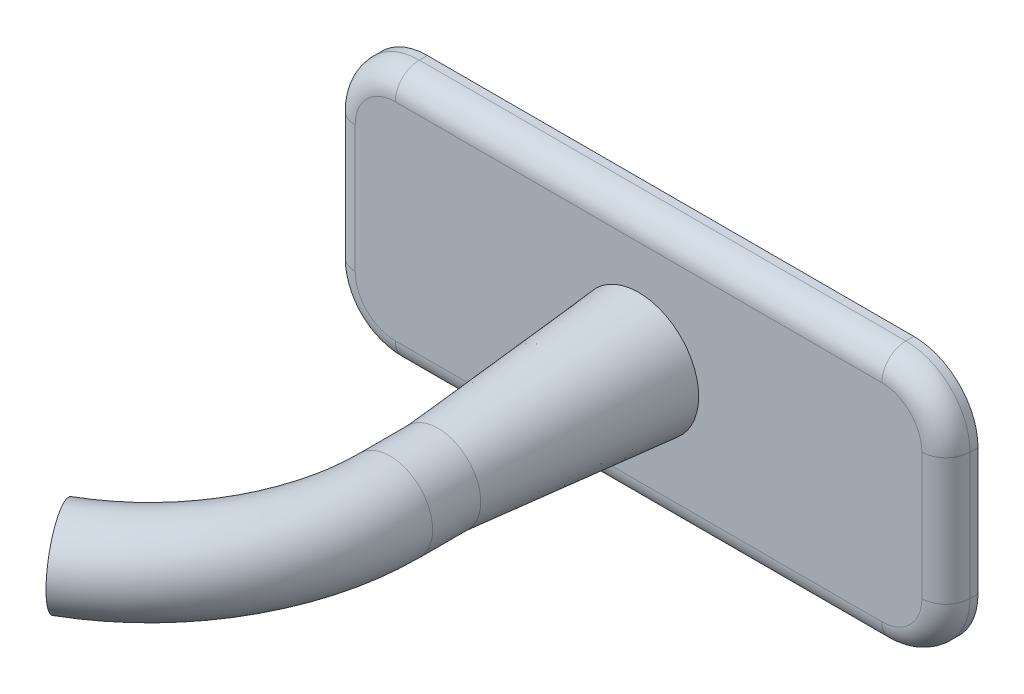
from build123d import *

# Parameters (mm, degrees)
SKETCH1_W           = 19.481999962
SKETCH1_H           = 8.08482
BOSS_EXTRUDE1_DEPTH = 1.016
FILLET1_R           = 2.032
FILLET2_R           = 0.762
SKETCH2_R           = 1.905
BOSS_EXTRUDE2_DEPTH = 6.35
BOSS_EXTRUDE2_TAPER = 5
SKETCH3_R           = 1.349446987
BOSS_EXTRUDE3_DEPTH = 1.524
SKETCH4_R           = 1.349446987
REVOLVE1_ANGLE      = 60


with BuildPart() as part:
    # Sketch1 → Boss-Extrude1 (new body)
    with BuildSketch(Plane.XY):
        Rectangle(SKETCH1_W, SKETCH1_H)
    extrude(amount=BOSS_EXTRUDE1_DEPTH)

    # Fillet1
    fillet1_edges = [part.edges().sort_by_distance(p)[0] for p in [
        (-9.740999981, 4.04241, 0.508),
        (9.740999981, 4.04241, 0.508),
        (9.740999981, -4.04241, 0.508),
        (-9.740999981, -4.04241, 0.508),
    ]]
    fillet(fillet1_edges, radius=FILLET1_R)

    # Fillet2
    fillet2_edges = [part.edges().sort_by_distance(p)[0] for p in [
        (-9.740999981, 0, 1.016),
        (0, 4.04241, 1.016),
        (0, -4.04241, 1.016),
        (9.740999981, 0, 1.016),
        (9.14584096, -3.447250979, 1.016),
        (9.14584096, 3.447250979, 1.016),
        (-9.14584096, -3.447250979, 1.016),
        (-9.14584096, 3.447250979, 1.016),
    ]]
    fillet(fillet2_edges, radius=FILLET2_R)

    # Sketch2 → Boss-Extrude2 (add)
    with BuildSketch(Plane.XY.offset(1.016)):
        Circle(SKETCH2_R)
    extrude(amount=BOSS_EXTRUDE2_DEPTH, taper=BOSS_EXTRUDE2_TAPER)

    # Sketch3 → Boss-Extrude3 (add)
    with BuildSketch(Plane.XY.offset(7.366)):
        with Locations(Location((0, 0, 0), (0, 0, 180))):
            Circle(SKETCH3_R)
    extrude(amount=BOSS_EXTRUDE3_DEPTH)

    # Sketch4 → Revolve1 (revolve)
    with BuildSketch(Plane.XY.offset(8.89)):
        Circle(SKETCH4_R)
    revolve(axis=Axis((-7.62, -3.161796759, 8.89), (0, -1, 0)), revolution_arc=REVOLVE1_ANGLE)


solid = part.part
